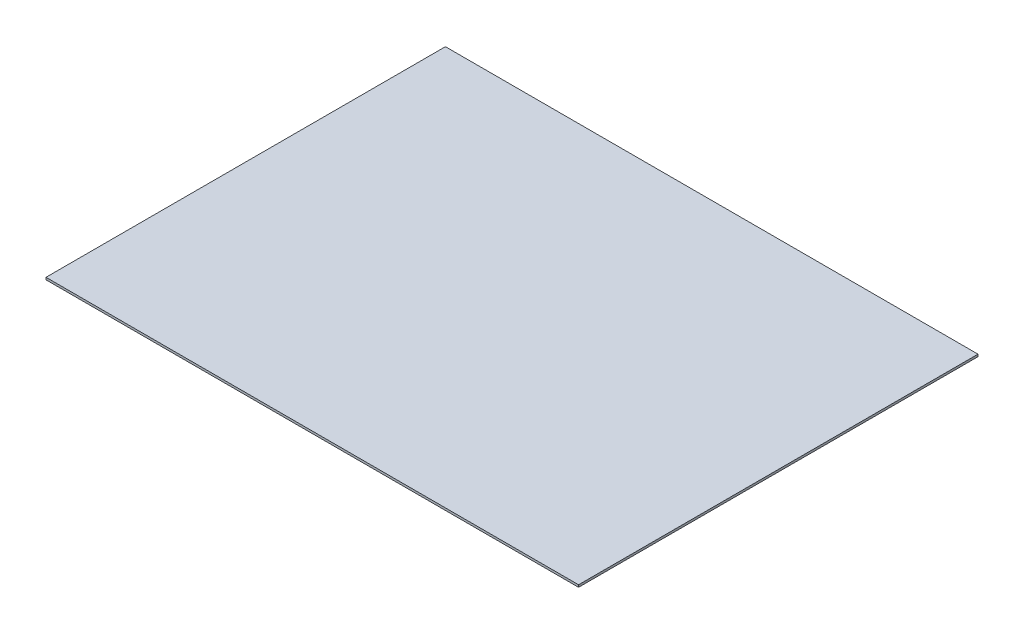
from build123d import *

# Parameters (mm, degrees)
SKETCH1_W           = 2400
SKETCH1_H           = 1800
BOSS_EXTRUDE1_DEPTH = 10


with BuildPart() as part:
    # Sketch1 → Boss-Extrude1 (new body)
    with BuildSketch(Plane(origin=(0, 0, 0), x_dir=(1, 0, 0), z_dir=(0, 1, 0))):
        Rectangle(SKETCH1_W, SKETCH1_H)
    extrude(amount=BOSS_EXTRUDE1_DEPTH)


solid = part.part
